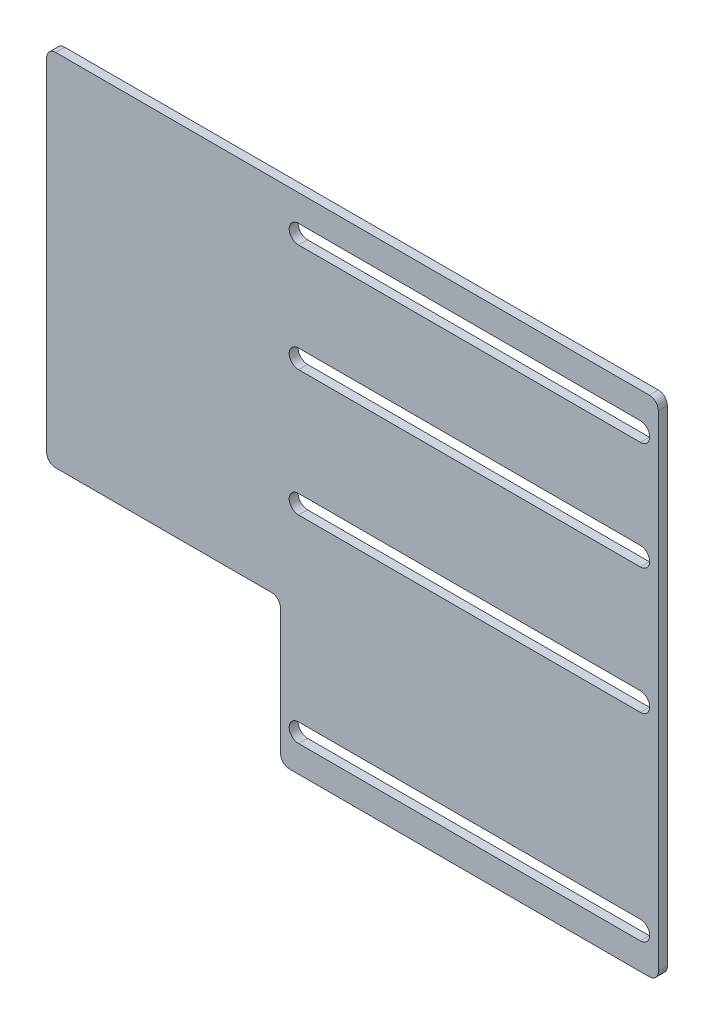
from build123d import *

# Parameters (mm, degrees)
BOSS_EXTRUDE1_DEPTH = 3.175
SLOTTED_HOLES_DEPTH = 223.272677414
FILLET1_R           = 3.175


with BuildPart() as part:
    # Sketch1 → Boss-Extrude1 (new body)
    with BuildSketch(Plane.XY):
        Polygon((0, 0), (0, 50.8), (-82.55, 50.8), (-82.55, 177.8), (133.35, 177.8), (133.35, 0), align=None)
    extrude(amount=BOSS_EXTRUDE1_DEPTH)

    # Sketch2 → Slotted Holes (cut, through all)
    with BuildSketch(Plane.XY.offset(3.175)):
        with BuildLine():
            Line((6.35, 168.402), (127, 168.402))
            ThreePointArc((127, 168.402), (130.302, 165.1), (127, 161.798))
            Line((127, 161.798), (6.35, 161.798))
            ThreePointArc((6.35, 161.798), (3.048, 165.1), (6.35, 168.402))
        make_face()
        with BuildLine():
            Line((6.35, 130.302), (127, 130.302))
            ThreePointArc((127, 130.302), (130.302, 127), (127, 123.698))
            Line((127, 123.698), (6.35, 123.698))
            ThreePointArc((6.35, 123.698), (3.048, 127), (6.35, 130.302))
        make_face()
        with BuildLine():
            Line((6.35, 85.852), (127, 85.852))
            ThreePointArc((127, 85.852), (130.302, 82.55), (127, 79.248))
            Line((127, 79.248), (6.35, 79.248))
            ThreePointArc((6.35, 79.248), (3.048, 82.55), (6.35, 85.852))
        make_face()
        with BuildLine():
            Line((6.35, 16.002), (127, 16.002))
            ThreePointArc((127, 16.002), (130.302, 12.7), (127, 9.398))
            Line((127, 9.398), (6.35, 9.398))
            ThreePointArc((6.35, 9.398), (3.048, 12.7), (6.35, 16.002))
        make_face()
    extrude(amount=-SLOTTED_HOLES_DEPTH, mode=Mode.SUBTRACT)

    # Fillet1
    fillet1_edges = [part.edges().sort_by_distance(p)[0] for p in [
        (0, 0, 1.5875),
        (0, 50.8, 1.5875),
        (-82.55, 50.8, 1.5875),
        (-82.55, 177.8, 1.5875),
        (133.35, 177.8, 1.5875),
        (133.35, 0, 1.5875),
    ]]
    fillet(fillet1_edges, radius=FILLET1_R)


solid = part.part
